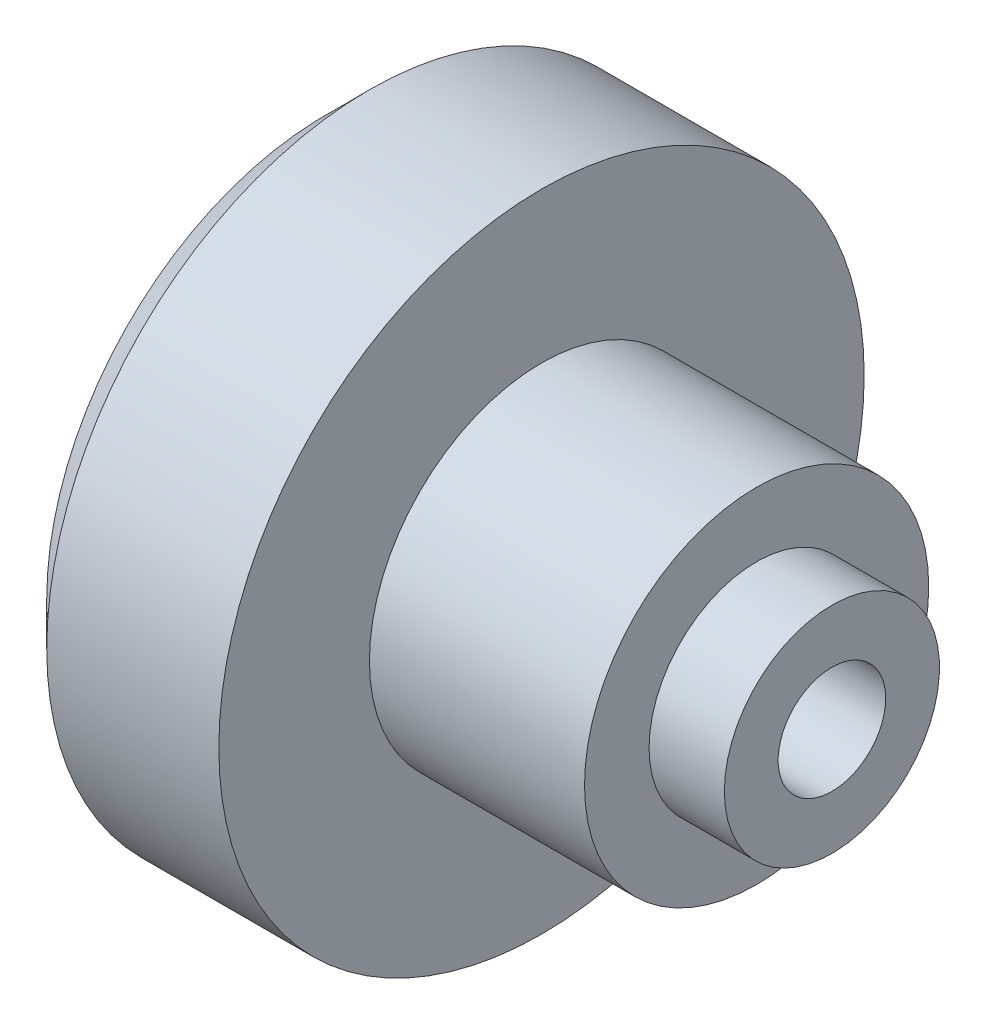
ISO-10303-21;
HEADER;
FILE_DESCRIPTION(('STEP AP214'),'2;1');
FILE_NAME('part.step','',(''),(''),'','','');
FILE_SCHEMA(('AUTOMOTIVE_DESIGN { 1 0 10303 214 1 1 1 1 }'));
ENDSEC;
DATA;
#1=APPLICATION_CONTEXT('core data for automotive mechanical design processes');
#2=APPLICATION_PROTOCOL_DEFINITION('international standard','automotive_design',2000,#1);
#3=PRODUCT_CONTEXT('',#1,'mechanical');
#4=PRODUCT('Part','Part','',(#3));
#5=PRODUCT_RELATED_PRODUCT_CATEGORY('part','',(#4));
#6=PRODUCT_DEFINITION_FORMATION('','',#4);
#7=PRODUCT_DEFINITION_CONTEXT('part definition',#1,'design');
#8=PRODUCT_DEFINITION('design','',#6,#7);
#9=PRODUCT_DEFINITION_SHAPE('','',#8);
#10=(LENGTH_UNIT() NAMED_UNIT(*) SI_UNIT(.MILLI.,.METRE.));
#11=(NAMED_UNIT(*) PLANE_ANGLE_UNIT() SI_UNIT($,.RADIAN.));
#12=(NAMED_UNIT(*) SI_UNIT($,.STERADIAN.) SOLID_ANGLE_UNIT());
#13=UNCERTAINTY_MEASURE_WITH_UNIT(LENGTH_MEASURE(1.E-05),#10,'distance_accuracy_value','');
#14=(GEOMETRIC_REPRESENTATION_CONTEXT(3) GLOBAL_UNCERTAINTY_ASSIGNED_CONTEXT((#13)) GLOBAL_UNIT_ASSIGNED_CONTEXT((#10,
#11,#12)) REPRESENTATION_CONTEXT('',''));
#15=CARTESIAN_POINT('',(0.,0.,0.));
#16=DIRECTION('',(0.,0.,1.));
#17=DIRECTION('',(1.,0.,0.));
#18=AXIS2_PLACEMENT_3D('',#15,#16,#17);
#19=CARTESIAN_POINT('',(0.,0.,0.));
#20=DIRECTION('',(1.,0.,0.));
#21=DIRECTION('',(0.,0.,-1.));
#22=AXIS2_PLACEMENT_3D('',#19,#20,#21);
#23=PLANE('',#22);
#24=CARTESIAN_POINT('',(0.,0.,0.));
#25=DIRECTION('',(1.,0.,0.));
#26=DIRECTION('',(0.,0.,-1.));
#27=AXIS2_PLACEMENT_3D('',#24,#25,#26);
#28=CIRCLE('',#27,13.);
#29=CARTESIAN_POINT('',(0.,0.,-13.));
#30=VERTEX_POINT('',#29);
#31=EDGE_CURVE('E40',#30,#30,#28,.F.);
#32=ORIENTED_EDGE('',*,*,#31,.T.);
#33=EDGE_LOOP('',(#32));
#34=FACE_BOUND('',#33,.T.);
#35=ADVANCED_FACE('F33',(#34),#23,.F.);
#36=CARTESIAN_POINT('',(0.,0.,0.));
#37=DIRECTION('',(-1.,0.,0.));
#38=DIRECTION('',(0.,0.,1.));
#39=AXIS2_PLACEMENT_3D('',#36,#37,#38);
#40=CYLINDRICAL_SURFACE('',#39,15.);
#41=CARTESIAN_POINT('',(2.00000000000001,0.,0.));
#42=DIRECTION('',(1.,0.,0.));
#43=DIRECTION('',(0.,0.,-1.));
#44=AXIS2_PLACEMENT_3D('',#41,#42,#43);
#45=CIRCLE('',#44,15.);
#46=CARTESIAN_POINT('',(2.00000000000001,0.,-15.));
#47=VERTEX_POINT('',#46);
#48=EDGE_CURVE('E11',#47,#47,#45,.T.);
#49=ORIENTED_EDGE('',*,*,#48,.T.);
#50=EDGE_LOOP('',(#49));
#51=FACE_BOUND('',#50,.T.);
#52=CARTESIAN_POINT('',(10.,0.,0.));
#53=DIRECTION('',(-1.,0.,0.));
#54=DIRECTION('',(0.,0.,1.));
#55=AXIS2_PLACEMENT_3D('',#52,#53,#54);
#56=CIRCLE('',#55,15.);
#57=CARTESIAN_POINT('',(10.,0.,15.));
#58=VERTEX_POINT('',#57);
#59=EDGE_CURVE('E70',#58,#58,#56,.T.);
#60=ORIENTED_EDGE('',*,*,#59,.T.);
#61=EDGE_LOOP('',(#60));
#62=FACE_BOUND('',#61,.T.);
#63=ADVANCED_FACE('F84',(#51,#62),#40,.T.);
#64=CARTESIAN_POINT('',(10.,15.,0.));
#65=DIRECTION('',(-1.,0.,0.));
#66=DIRECTION('',(0.,0.,1.));
#67=AXIS2_PLACEMENT_3D('',#64,#65,#66);
#68=PLANE('',#67);
#69=ORIENTED_EDGE('',*,*,#59,.F.);
#70=EDGE_LOOP('',(#69));
#71=FACE_BOUND('',#70,.T.);
#72=CARTESIAN_POINT('',(10.,0.,0.));
#73=DIRECTION('',(-1.,0.,0.));
#74=DIRECTION('',(0.,0.,1.));
#75=AXIS2_PLACEMENT_3D('',#72,#73,#74);
#76=CIRCLE('',#75,8.);
#77=CARTESIAN_POINT('',(10.,0.,8.));
#78=VERTEX_POINT('',#77);
#79=EDGE_CURVE('E67',#78,#78,#76,.T.);
#80=ORIENTED_EDGE('',*,*,#79,.T.);
#81=EDGE_LOOP('',(#80));
#82=FACE_BOUND('',#81,.T.);
#83=ADVANCED_FACE('F88',(#71,#82),#68,.F.);
#84=CARTESIAN_POINT('',(0.,0.,0.));
#85=DIRECTION('',(-1.,0.,0.));
#86=DIRECTION('',(0.,0.,1.));
#87=AXIS2_PLACEMENT_3D('',#84,#85,#86);
#88=CYLINDRICAL_SURFACE('',#87,8.);
#89=ORIENTED_EDGE('',*,*,#79,.F.);
#90=EDGE_LOOP('',(#89));
#91=FACE_BOUND('',#90,.T.);
#92=CARTESIAN_POINT('',(20.,0.,0.));
#93=DIRECTION('',(-1.,0.,0.));
#94=DIRECTION('',(0.,0.,1.));
#95=AXIS2_PLACEMENT_3D('',#92,#93,#94);
#96=CIRCLE('',#95,8.);
#97=CARTESIAN_POINT('',(20.,0.,8.));
#98=VERTEX_POINT('',#97);
#99=EDGE_CURVE('E64',#98,#98,#96,.T.);
#100=ORIENTED_EDGE('',*,*,#99,.T.);
#101=EDGE_LOOP('',(#100));
#102=FACE_BOUND('',#101,.T.);
#103=ADVANCED_FACE('F94',(#91,#102),#88,.T.);
#104=CARTESIAN_POINT('',(20.,8.,0.));
#105=DIRECTION('',(-1.,0.,0.));
#106=DIRECTION('',(0.,0.,1.));
#107=AXIS2_PLACEMENT_3D('',#104,#105,#106);
#108=PLANE('',#107);
#109=ORIENTED_EDGE('',*,*,#99,.F.);
#110=EDGE_LOOP('',(#109));
#111=FACE_BOUND('',#110,.T.);
#112=CARTESIAN_POINT('',(20.,0.,0.));
#113=DIRECTION('',(-1.,0.,0.));
#114=DIRECTION('',(0.,0.,1.));
#115=AXIS2_PLACEMENT_3D('',#112,#113,#114);
#116=CIRCLE('',#115,5.);
#117=CARTESIAN_POINT('',(20.,0.,5.));
#118=VERTEX_POINT('',#117);
#119=EDGE_CURVE('E57',#118,#118,#116,.T.);
#120=ORIENTED_EDGE('',*,*,#119,.T.);
#121=EDGE_LOOP('',(#120));
#122=FACE_BOUND('',#121,.T.);
#123=ADVANCED_FACE('F98',(#111,#122),#108,.F.);
#124=CARTESIAN_POINT('',(0.,0.,0.));
#125=DIRECTION('',(-1.,0.,0.));
#126=DIRECTION('',(0.,0.,1.));
#127=AXIS2_PLACEMENT_3D('',#124,#125,#126);
#128=CYLINDRICAL_SURFACE('',#127,5.);
#129=ORIENTED_EDGE('',*,*,#119,.F.);
#130=EDGE_LOOP('',(#129));
#131=FACE_BOUND('',#130,.T.);
#132=CARTESIAN_POINT('',(23.5,0.,0.));
#133=DIRECTION('',(-1.,0.,0.));
#134=DIRECTION('',(0.,0.,1.));
#135=AXIS2_PLACEMENT_3D('',#132,#133,#134);
#136=CIRCLE('',#135,5.);
#137=CARTESIAN_POINT('',(23.5,0.,5.));
#138=VERTEX_POINT('',#137);
#139=EDGE_CURVE('E53',#138,#138,#136,.T.);
#140=ORIENTED_EDGE('',*,*,#139,.T.);
#141=EDGE_LOOP('',(#140));
#142=FACE_BOUND('',#141,.T.);
#143=ADVANCED_FACE('F102',(#131,#142),#128,.T.);
#144=CARTESIAN_POINT('',(23.5,5.,0.));
#145=DIRECTION('',(-1.,0.,0.));
#146=DIRECTION('',(0.,0.,1.));
#147=AXIS2_PLACEMENT_3D('',#144,#145,#146);
#148=PLANE('',#147);
#149=CARTESIAN_POINT('',(23.5,0.,0.));
#150=DIRECTION('',(1.,0.,0.));
#151=DIRECTION('',(0.,0.,-1.));
#152=AXIS2_PLACEMENT_3D('',#149,#150,#151);
#153=CIRCLE('',#152,2.49999999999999);
#154=CARTESIAN_POINT('',(23.5,0.,-2.49999999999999));
#155=VERTEX_POINT('',#154);
#156=EDGE_CURVE('E54',#155,#155,#153,.T.);
#157=ORIENTED_EDGE('',*,*,#156,.F.);
#158=EDGE_LOOP('',(#157));
#159=FACE_BOUND('',#158,.T.);
#160=ORIENTED_EDGE('',*,*,#139,.F.);
#161=EDGE_LOOP('',(#160));
#162=FACE_BOUND('',#161,.T.);
#163=ADVANCED_FACE('F47',(#159,#162),#148,.F.);
#164=CARTESIAN_POINT('',(8.5,0.,0.));
#165=DIRECTION('',(1.,0.,0.));
#166=DIRECTION('',(0.,0.,-1.));
#167=AXIS2_PLACEMENT_3D('',#164,#165,#166);
#168=CONICAL_SURFACE('',#167,2.5,1.02974425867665);
#169=CARTESIAN_POINT('',(6.9978484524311,0.,0.));
#170=VERTEX_POINT('',#169);
#171=VERTEX_LOOP('',#170);
#172=FACE_BOUND('',#171,.T.);
#173=CARTESIAN_POINT('',(8.5,0.,0.));
#174=DIRECTION('',(1.,0.,0.));
#175=DIRECTION('',(0.,0.,-1.));
#176=AXIS2_PLACEMENT_3D('',#173,#174,#175);
#177=CIRCLE('',#176,2.5);
#178=CARTESIAN_POINT('',(8.5,0.,-2.5));
#179=VERTEX_POINT('',#178);
#180=EDGE_CURVE('E51',#179,#179,#177,.T.);
#181=ORIENTED_EDGE('',*,*,#180,.T.);
#182=EDGE_LOOP('',(#181));
#183=FACE_BOUND('',#182,.T.);
#184=ADVANCED_FACE('F43',(#172,#183),#168,.F.);
#185=CARTESIAN_POINT('',(23.5,0.,0.));
#186=DIRECTION('',(1.,0.,0.));
#187=DIRECTION('',(0.,0.,-1.));
#188=AXIS2_PLACEMENT_3D('',#185,#186,#187);
#189=CYLINDRICAL_SURFACE('',#188,2.49999999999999);
#190=ORIENTED_EDGE('',*,*,#180,.F.);
#191=EDGE_LOOP('',(#190));
#192=FACE_BOUND('',#191,.T.);
#193=ORIENTED_EDGE('',*,*,#156,.T.);
#194=EDGE_LOOP('',(#193));
#195=FACE_BOUND('',#194,.T.);
#196=ADVANCED_FACE('F46',(#192,#195),#189,.F.);
#197=CARTESIAN_POINT('',(0.,0.,0.));
#198=DIRECTION('',(1.,0.,0.));
#199=DIRECTION('',(0.,0.,-1.));
#200=AXIS2_PLACEMENT_3D('',#197,#198,#199);
#201=CONICAL_SURFACE('',#200,13.,0.785398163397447);
#202=ORIENTED_EDGE('',*,*,#48,.F.);
#203=EDGE_LOOP('',(#202));
#204=FACE_BOUND('',#203,.T.);
#205=ORIENTED_EDGE('',*,*,#31,.F.);
#206=EDGE_LOOP('',(#205));
#207=FACE_BOUND('',#206,.T.);
#208=ADVANCED_FACE('F35',(#204,#207),#201,.T.);
#209=CLOSED_SHELL('',(#35,#63,#83,#103,#123,#143,#163,#184,#196,#208));
#210=MANIFOLD_SOLID_BREP('B2',#209);
#211=ADVANCED_BREP_SHAPE_REPRESENTATION('',(#18,#210),#14);
#212=SHAPE_DEFINITION_REPRESENTATION(#9,#211);
ENDSEC;
END-ISO-10303-21;
